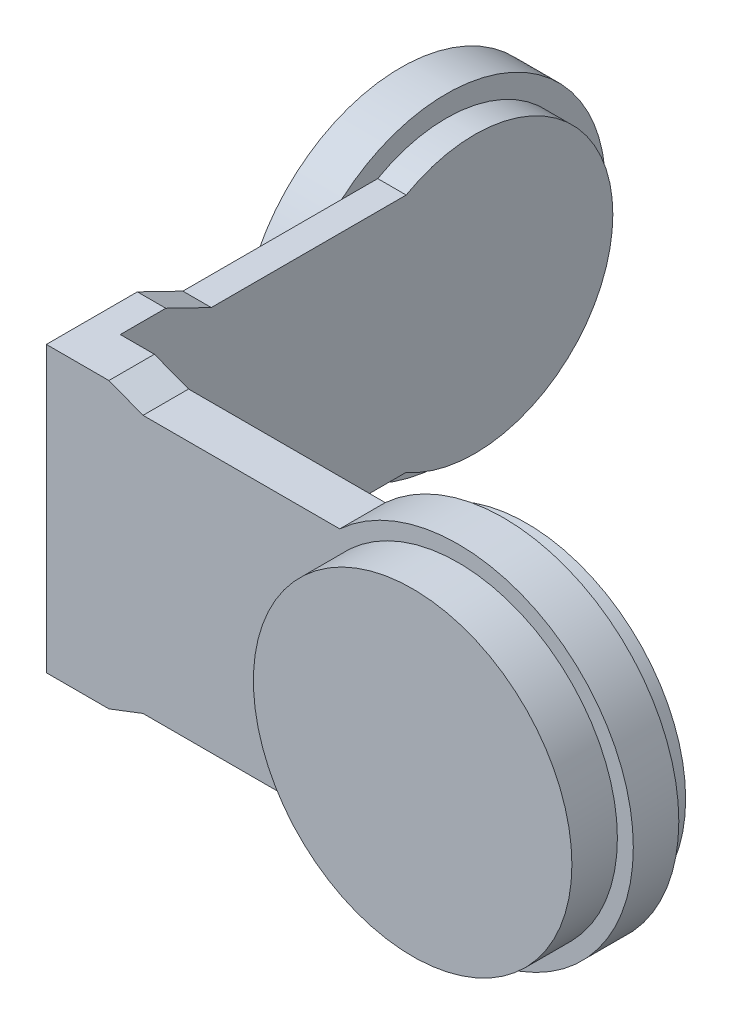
ISO-10303-21;
HEADER;
FILE_DESCRIPTION(('STEP AP214'),'2;1');
FILE_NAME('part.step','',(''),(''),'','','');
FILE_SCHEMA(('AUTOMOTIVE_DESIGN { 1 0 10303 214 1 1 1 1 }'));
ENDSEC;
DATA;
#1=APPLICATION_CONTEXT('core data for automotive mechanical design processes');
#2=APPLICATION_PROTOCOL_DEFINITION('international standard','automotive_design',2000,#1);
#3=PRODUCT_CONTEXT('',#1,'mechanical');
#4=PRODUCT('Part','Part','',(#3));
#5=PRODUCT_RELATED_PRODUCT_CATEGORY('part','',(#4));
#6=PRODUCT_DEFINITION_FORMATION('','',#4);
#7=PRODUCT_DEFINITION_CONTEXT('part definition',#1,'design');
#8=PRODUCT_DEFINITION('design','',#6,#7);
#9=PRODUCT_DEFINITION_SHAPE('','',#8);
#10=(LENGTH_UNIT() NAMED_UNIT(*) SI_UNIT(.MILLI.,.METRE.));
#11=(NAMED_UNIT(*) PLANE_ANGLE_UNIT() SI_UNIT($,.RADIAN.));
#12=(NAMED_UNIT(*) SI_UNIT($,.STERADIAN.) SOLID_ANGLE_UNIT());
#13=UNCERTAINTY_MEASURE_WITH_UNIT(LENGTH_MEASURE(1.E-05),#10,'distance_accuracy_value','');
#14=(GEOMETRIC_REPRESENTATION_CONTEXT(3) GLOBAL_UNCERTAINTY_ASSIGNED_CONTEXT((#13)) GLOBAL_UNIT_ASSIGNED_CONTEXT((#10,
#11,#12)) REPRESENTATION_CONTEXT('',''));
#15=CARTESIAN_POINT('',(0.,0.,0.));
#16=DIRECTION('',(0.,0.,1.));
#17=DIRECTION('',(1.,0.,0.));
#18=AXIS2_PLACEMENT_3D('',#15,#16,#17);
#19=CARTESIAN_POINT('',(6.5,0.,0.));
#20=DIRECTION('',(1.,0.,0.));
#21=DIRECTION('',(0.,0.,-1.));
#22=AXIS2_PLACEMENT_3D('',#19,#20,#21);
#23=PLANE('',#22);
#24=DIRECTION('',(0.,0.,1.));
#25=VECTOR('',#24,1.);
#26=CARTESIAN_POINT('',(6.5,12.5,35.15));
#27=LINE('',#26,#25);
#28=CARTESIAN_POINT('',(6.5,12.5,27.15));
#29=VERTEX_POINT('',#28);
#30=CARTESIAN_POINT('',(6.5,12.5,31.15));
#31=VERTEX_POINT('',#30);
#32=EDGE_CURVE('E216',#29,#31,#27,.T.);
#33=ORIENTED_EDGE('',*,*,#32,.T.);
#34=DIRECTION('',(0.,-1.,0.));
#35=VECTOR('',#34,1.);
#36=CARTESIAN_POINT('',(6.5,12.5,31.15));
#37=LINE('',#36,#35);
#38=CARTESIAN_POINT('',(6.5,-12.5,31.15));
#39=VERTEX_POINT('',#38);
#40=EDGE_CURVE('E162',#31,#39,#37,.T.);
#41=ORIENTED_EDGE('',*,*,#40,.T.);
#42=DIRECTION('',(0.,0.,-1.));
#43=VECTOR('',#42,1.);
#44=CARTESIAN_POINT('',(6.5,-12.5,35.15));
#45=LINE('',#44,#43);
#46=CARTESIAN_POINT('',(6.5,-12.5,27.15));
#47=VERTEX_POINT('',#46);
#48=EDGE_CURVE('E161',#39,#47,#45,.T.);
#49=ORIENTED_EDGE('',*,*,#48,.T.);
#50=DIRECTION('',(0.,0.437246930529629,-0.899341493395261));
#51=VECTOR('',#50,1.);
#52=CARTESIAN_POINT('',(6.5,-12.5,27.15));
#53=LINE('',#52,#51);
#54=CARTESIAN_POINT('',(6.5,-10.5552573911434,23.15));
#55=VERTEX_POINT('',#54);
#56=EDGE_CURVE('E204',#47,#55,#53,.T.);
#57=ORIENTED_EDGE('',*,*,#56,.T.);
#58=DIRECTION('',(0.,0.,-1.));
#59=VECTOR('',#58,1.);
#60=CARTESIAN_POINT('',(6.5,-10.5552573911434,23.15));
#61=LINE('',#60,#59);
#62=CARTESIAN_POINT('',(6.5,-10.5552573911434,6.0173949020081));
#63=VERTEX_POINT('',#62);
#64=EDGE_CURVE('E207',#55,#63,#61,.T.);
#65=ORIENTED_EDGE('',*,*,#64,.T.);
#66=CARTESIAN_POINT('',(6.5,0.,0.));
#67=DIRECTION('',(1.,0.,0.));
#68=DIRECTION('',(0.,0.,-1.));
#69=AXIS2_PLACEMENT_3D('',#66,#67,#68);
#70=CIRCLE('',#69,12.15);
#71=CARTESIAN_POINT('',(6.5,10.5552573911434,6.0173949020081));
#72=VERTEX_POINT('',#71);
#73=EDGE_CURVE('E210',#63,#72,#70,.T.);
#74=ORIENTED_EDGE('',*,*,#73,.T.);
#75=DIRECTION('',(0.,0.,1.));
#76=VECTOR('',#75,1.);
#77=CARTESIAN_POINT('',(6.5,10.5552573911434,23.15));
#78=LINE('',#77,#76);
#79=CARTESIAN_POINT('',(6.5,10.5552573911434,23.15));
#80=VERTEX_POINT('',#79);
#81=EDGE_CURVE('E212',#72,#80,#78,.T.);
#82=ORIENTED_EDGE('',*,*,#81,.T.);
#83=DIRECTION('',(0.,0.437246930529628,0.899341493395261));
#84=VECTOR('',#83,1.);
#85=CARTESIAN_POINT('',(6.5,12.5,27.15));
#86=LINE('',#85,#84);
#87=EDGE_CURVE('E214',#80,#29,#86,.T.);
#88=ORIENTED_EDGE('',*,*,#87,.T.);
#89=EDGE_LOOP('',(#33,#41,#49,#57,#65,#74,#82,#88));
#90=FACE_BOUND('',#89,.T.);
#91=ADVANCED_FACE('F33',(#90),#23,.T.);
#92=CARTESIAN_POINT('',(4.,0.,0.));
#93=DIRECTION('',(-1.,0.,0.));
#94=DIRECTION('',(0.,0.,1.));
#95=AXIS2_PLACEMENT_3D('',#92,#93,#94);
#96=CYLINDRICAL_SURFACE('',#95,14.);
#97=CARTESIAN_POINT('',(4.,0.,0.));
#98=DIRECTION('',(1.,0.,0.));
#99=DIRECTION('',(0.,0.,-1.));
#100=AXIS2_PLACEMENT_3D('',#97,#98,#99);
#101=CIRCLE('',#100,14.);
#102=CARTESIAN_POINT('',(4.,10.5552573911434,9.19709418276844));
#103=VERTEX_POINT('',#102);
#104=CARTESIAN_POINT('',(4.,-10.5552573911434,9.19709418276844));
#105=VERTEX_POINT('',#104);
#106=EDGE_CURVE('E261',#103,#105,#101,.T.);
#107=ORIENTED_EDGE('',*,*,#106,.F.);
#108=EDGE_CURVE('E263',#105,#103,#101,.T.);
#109=ORIENTED_EDGE('',*,*,#108,.F.);
#110=EDGE_LOOP('',(#107,#109));
#111=FACE_BOUND('',#110,.T.);
#112=CARTESIAN_POINT('',(0.,0.,0.));
#113=DIRECTION('',(1.,0.,0.));
#114=DIRECTION('',(0.,0.,-1.));
#115=AXIS2_PLACEMENT_3D('',#112,#113,#114);
#116=CIRCLE('',#115,14.);
#117=CARTESIAN_POINT('',(0.,0.,-14.));
#118=VERTEX_POINT('',#117);
#119=EDGE_CURVE('E260',#118,#118,#116,.T.);
#120=ORIENTED_EDGE('',*,*,#119,.T.);
#121=EDGE_LOOP('',(#120));
#122=FACE_BOUND('',#121,.T.);
#123=ADVANCED_FACE('F35',(#111,#122),#96,.T.);
#124=CARTESIAN_POINT('',(4.,0.,0.));
#125=DIRECTION('',(1.,0.,0.));
#126=DIRECTION('',(0.,0.,-1.));
#127=AXIS2_PLACEMENT_3D('',#124,#125,#126);
#128=PLANE('',#127);
#129=DIRECTION('',(0.,0.,1.));
#130=VECTOR('',#129,1.);
#131=CARTESIAN_POINT('',(4.,10.5552573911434,23.15));
#132=LINE('',#131,#130);
#133=CARTESIAN_POINT('',(4.,10.5552573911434,6.0173949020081));
#134=VERTEX_POINT('',#133);
#135=EDGE_CURVE('E56',#134,#103,#132,.T.);
#136=ORIENTED_EDGE('',*,*,#135,.F.);
#137=CARTESIAN_POINT('',(4.,0.,0.));
#138=DIRECTION('',(1.,0.,0.));
#139=DIRECTION('',(0.,0.,-1.));
#140=AXIS2_PLACEMENT_3D('',#137,#138,#139);
#141=CIRCLE('',#140,12.15);
#142=CARTESIAN_POINT('',(4.,-10.5552573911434,6.0173949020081));
#143=VERTEX_POINT('',#142);
#144=EDGE_CURVE('E226',#143,#134,#141,.T.);
#145=ORIENTED_EDGE('',*,*,#144,.F.);
#146=DIRECTION('',(0.,0.,-1.));
#147=VECTOR('',#146,1.);
#148=CARTESIAN_POINT('',(4.,-10.5552573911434,23.15));
#149=LINE('',#148,#147);
#150=EDGE_CURVE('E227',#105,#143,#149,.T.);
#151=ORIENTED_EDGE('',*,*,#150,.F.);
#152=ORIENTED_EDGE('',*,*,#108,.T.);
#153=EDGE_LOOP('',(#136,#145,#151,#152));
#154=FACE_BOUND('',#153,.T.);
#155=ADVANCED_FACE('F269',(#154),#128,.T.);
#156=CARTESIAN_POINT('',(0.,0.,0.));
#157=DIRECTION('',(1.,0.,0.));
#158=DIRECTION('',(0.,0.,-1.));
#159=AXIS2_PLACEMENT_3D('',#156,#157,#158);
#160=PLANE('',#159);
#161=ORIENTED_EDGE('',*,*,#119,.F.);
#162=EDGE_LOOP('',(#161));
#163=FACE_BOUND('',#162,.T.);
#164=ADVANCED_FACE('F330',(#163),#160,.F.);
#165=CARTESIAN_POINT('',(4.,0.,0.));
#166=DIRECTION('',(1.,0.,0.));
#167=DIRECTION('',(0.,0.,-1.));
#168=AXIS2_PLACEMENT_3D('',#165,#166,#167);
#169=PLANE('',#168);
#170=CARTESIAN_POINT('',(4.,10.5552573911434,23.15));
#171=VERTEX_POINT('',#170);
#172=EDGE_CURVE('E229',#103,#171,#132,.T.);
#173=ORIENTED_EDGE('',*,*,#172,.F.);
#174=ORIENTED_EDGE('',*,*,#106,.T.);
#175=CARTESIAN_POINT('',(4.,-10.5552573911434,23.15));
#176=VERTEX_POINT('',#175);
#177=EDGE_CURVE('E223',#176,#105,#149,.T.);
#178=ORIENTED_EDGE('',*,*,#177,.F.);
#179=DIRECTION('',(0.,0.437246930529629,-0.899341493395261));
#180=VECTOR('',#179,1.);
#181=CARTESIAN_POINT('',(4.,-12.5,27.15));
#182=LINE('',#181,#180);
#183=CARTESIAN_POINT('',(4.,-12.5,27.15));
#184=VERTEX_POINT('',#183);
#185=EDGE_CURVE('E196',#184,#176,#182,.T.);
#186=ORIENTED_EDGE('',*,*,#185,.F.);
#187=DIRECTION('',(0.,0.,-1.));
#188=VECTOR('',#187,1.);
#189=CARTESIAN_POINT('',(4.,-12.5,35.15));
#190=LINE('',#189,#188);
#191=CARTESIAN_POINT('',(4.,-12.5,35.15));
#192=VERTEX_POINT('',#191);
#193=EDGE_CURVE('E208',#192,#184,#190,.T.);
#194=ORIENTED_EDGE('',*,*,#193,.F.);
#195=DIRECTION('',(0.,-1.,0.));
#196=VECTOR('',#195,1.);
#197=CARTESIAN_POINT('',(4.,12.5,35.15));
#198=LINE('',#197,#196);
#199=CARTESIAN_POINT('',(4.,12.5,35.15));
#200=VERTEX_POINT('',#199);
#201=EDGE_CURVE('E235',#200,#192,#198,.T.);
#202=ORIENTED_EDGE('',*,*,#201,.F.);
#203=DIRECTION('',(0.,0.,1.));
#204=VECTOR('',#203,1.);
#205=CARTESIAN_POINT('',(4.,12.5,35.15));
#206=LINE('',#205,#204);
#207=CARTESIAN_POINT('',(4.,12.5,27.15));
#208=VERTEX_POINT('',#207);
#209=EDGE_CURVE('E233',#208,#200,#206,.T.);
#210=ORIENTED_EDGE('',*,*,#209,.F.);
#211=DIRECTION('',(0.,0.437246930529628,0.899341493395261));
#212=VECTOR('',#211,1.);
#213=CARTESIAN_POINT('',(4.,12.5,27.15));
#214=LINE('',#213,#212);
#215=EDGE_CURVE('E231',#171,#208,#214,.T.);
#216=ORIENTED_EDGE('',*,*,#215,.F.);
#217=EDGE_LOOP('',(#173,#174,#178,#186,#194,#202,#210,#216));
#218=FACE_BOUND('',#217,.T.);
#219=ADVANCED_FACE('F275',(#218),#169,.F.);
#220=CARTESIAN_POINT('',(6.5,-12.5,27.15));
#221=DIRECTION('',(0.,0.899341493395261,0.437246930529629));
#222=DIRECTION('',(0.,-0.437246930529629,0.899341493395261));
#223=AXIS2_PLACEMENT_3D('',#220,#221,#222);
#224=PLANE('',#223);
#225=ORIENTED_EDGE('',*,*,#185,.T.);
#226=DIRECTION('',(-1.,0.,0.));
#227=VECTOR('',#226,1.);
#228=CARTESIAN_POINT('',(6.5,-10.5552573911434,23.15));
#229=LINE('',#228,#227);
#230=EDGE_CURVE('E257',#55,#176,#229,.T.);
#231=ORIENTED_EDGE('',*,*,#230,.F.);
#232=ORIENTED_EDGE('',*,*,#56,.F.);
#233=DIRECTION('',(-1.,0.,0.));
#234=VECTOR('',#233,1.);
#235=CARTESIAN_POINT('',(6.5,-12.5,27.15));
#236=LINE('',#235,#234);
#237=EDGE_CURVE('E220',#47,#184,#236,.T.);
#238=ORIENTED_EDGE('',*,*,#237,.T.);
#239=EDGE_LOOP('',(#225,#231,#232,#238));
#240=FACE_BOUND('',#239,.T.);
#241=ADVANCED_FACE('F329',(#240),#224,.F.);
#242=CARTESIAN_POINT('',(6.5,-10.5552573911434,23.15));
#243=DIRECTION('',(0.,1.,0.));
#244=DIRECTION('',(0.,0.,1.));
#245=AXIS2_PLACEMENT_3D('',#242,#243,#244);
#246=PLANE('',#245);
#247=ORIENTED_EDGE('',*,*,#177,.T.);
#248=ORIENTED_EDGE('',*,*,#150,.T.);
#249=DIRECTION('',(-1.,0.,0.));
#250=VECTOR('',#249,1.);
#251=CARTESIAN_POINT('',(6.5,-10.5552573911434,6.0173949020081));
#252=LINE('',#251,#250);
#253=EDGE_CURVE('E254',#63,#143,#252,.T.);
#254=ORIENTED_EDGE('',*,*,#253,.F.);
#255=ORIENTED_EDGE('',*,*,#64,.F.);
#256=ORIENTED_EDGE('',*,*,#230,.T.);
#257=EDGE_LOOP('',(#247,#248,#254,#255,#256));
#258=FACE_BOUND('',#257,.T.);
#259=ADVANCED_FACE('F287',(#258),#246,.F.);
#260=CARTESIAN_POINT('',(6.5,0.,0.));
#261=DIRECTION('',(-1.,0.,0.));
#262=DIRECTION('',(0.,0.,1.));
#263=AXIS2_PLACEMENT_3D('',#260,#261,#262);
#264=CYLINDRICAL_SURFACE('',#263,12.15);
#265=ORIENTED_EDGE('',*,*,#144,.T.);
#266=DIRECTION('',(-1.,0.,0.));
#267=VECTOR('',#266,1.);
#268=CARTESIAN_POINT('',(6.5,10.5552573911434,6.0173949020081));
#269=LINE('',#268,#267);
#270=EDGE_CURVE('E251',#72,#134,#269,.T.);
#271=ORIENTED_EDGE('',*,*,#270,.F.);
#272=ORIENTED_EDGE('',*,*,#73,.F.);
#273=ORIENTED_EDGE('',*,*,#253,.T.);
#274=EDGE_LOOP('',(#265,#271,#272,#273));
#275=FACE_BOUND('',#274,.T.);
#276=ADVANCED_FACE('F284',(#275),#264,.T.);
#277=CARTESIAN_POINT('',(6.5,10.5552573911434,23.15));
#278=DIRECTION('',(0.,-1.,0.));
#279=DIRECTION('',(0.,0.,-1.));
#280=AXIS2_PLACEMENT_3D('',#277,#278,#279);
#281=PLANE('',#280);
#282=ORIENTED_EDGE('',*,*,#135,.T.);
#283=ORIENTED_EDGE('',*,*,#172,.T.);
#284=DIRECTION('',(-1.,0.,0.));
#285=VECTOR('',#284,1.);
#286=CARTESIAN_POINT('',(6.5,10.5552573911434,23.15));
#287=LINE('',#286,#285);
#288=EDGE_CURVE('E248',#80,#171,#287,.T.);
#289=ORIENTED_EDGE('',*,*,#288,.F.);
#290=ORIENTED_EDGE('',*,*,#81,.F.);
#291=ORIENTED_EDGE('',*,*,#270,.T.);
#292=EDGE_LOOP('',(#282,#283,#289,#290,#291));
#293=FACE_BOUND('',#292,.T.);
#294=ADVANCED_FACE('F279',(#293),#281,.F.);
#295=CARTESIAN_POINT('',(6.5,12.5,27.15));
#296=DIRECTION('',(0.,-0.899341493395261,0.437246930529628));
#297=DIRECTION('',(0.,-0.437246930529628,-0.899341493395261));
#298=AXIS2_PLACEMENT_3D('',#295,#296,#297);
#299=PLANE('',#298);
#300=ORIENTED_EDGE('',*,*,#215,.T.);
#301=DIRECTION('',(-1.,0.,0.));
#302=VECTOR('',#301,1.);
#303=CARTESIAN_POINT('',(6.5,12.5,27.15));
#304=LINE('',#303,#302);
#305=EDGE_CURVE('E245',#29,#208,#304,.T.);
#306=ORIENTED_EDGE('',*,*,#305,.F.);
#307=ORIENTED_EDGE('',*,*,#87,.F.);
#308=ORIENTED_EDGE('',*,*,#288,.T.);
#309=EDGE_LOOP('',(#300,#306,#307,#308));
#310=FACE_BOUND('',#309,.T.);
#311=ADVANCED_FACE('F341',(#310),#299,.F.);
#312=CARTESIAN_POINT('',(6.5,12.5,35.15));
#313=DIRECTION('',(0.,-1.,0.));
#314=DIRECTION('',(0.,0.,-1.));
#315=AXIS2_PLACEMENT_3D('',#312,#313,#314);
#316=PLANE('',#315);
#317=ORIENTED_EDGE('',*,*,#209,.T.);
#318=DIRECTION('',(-1.,0.,0.));
#319=VECTOR('',#318,1.);
#320=CARTESIAN_POINT('',(6.5,12.5,35.15));
#321=LINE('',#320,#319);
#322=CARTESIAN_POINT('',(9.5,12.5,35.15));
#323=VERTEX_POINT('',#322);
#324=EDGE_CURVE('E242',#323,#200,#321,.T.);
#325=ORIENTED_EDGE('',*,*,#324,.F.);
#326=DIRECTION('',(0.,0.,1.));
#327=VECTOR('',#326,1.);
#328=CARTESIAN_POINT('',(9.5,12.5,31.15));
#329=LINE('',#328,#327);
#330=CARTESIAN_POINT('',(9.5,12.5,31.15));
#331=VERTEX_POINT('',#330);
#332=EDGE_CURVE('E193',#331,#323,#329,.T.);
#333=ORIENTED_EDGE('',*,*,#332,.F.);
#334=DIRECTION('',(-1.,0.,0.));
#335=VECTOR('',#334,1.);
#336=CARTESIAN_POINT('',(6.5,12.5,31.15));
#337=LINE('',#336,#335);
#338=EDGE_CURVE('E150',#331,#31,#337,.T.);
#339=ORIENTED_EDGE('',*,*,#338,.T.);
#340=ORIENTED_EDGE('',*,*,#32,.F.);
#341=ORIENTED_EDGE('',*,*,#305,.T.);
#342=EDGE_LOOP('',(#317,#325,#333,#339,#340,#341));
#343=FACE_BOUND('',#342,.T.);
#344=ADVANCED_FACE('F337',(#343),#316,.F.);
#345=CARTESIAN_POINT('',(6.5,12.5,35.15));
#346=DIRECTION('',(0.,0.,-1.));
#347=DIRECTION('',(-1.,0.,0.));
#348=AXIS2_PLACEMENT_3D('',#345,#346,#347);
#349=PLANE('',#348);
#350=CARTESIAN_POINT('',(40.2,0.,35.15));
#351=DIRECTION('',(0.,0.,1.));
#352=DIRECTION('',(1.,0.,0.));
#353=AXIS2_PLACEMENT_3D('',#350,#351,#352);
#354=CIRCLE('',#353,14.);
#355=CARTESIAN_POINT('',(54.2,0.,35.15));
#356=VERTEX_POINT('',#355);
#357=EDGE_CURVE('E41',#356,#356,#354,.T.);
#358=ORIENTED_EDGE('',*,*,#357,.F.);
#359=EDGE_LOOP('',(#358));
#360=FACE_BOUND('',#359,.T.);
#361=ORIENTED_EDGE('',*,*,#201,.T.);
#362=DIRECTION('',(-1.,0.,0.));
#363=VECTOR('',#362,1.);
#364=CARTESIAN_POINT('',(6.5,-12.5,35.15));
#365=LINE('',#364,#363);
#366=CARTESIAN_POINT('',(9.5,-12.5,35.15));
#367=VERTEX_POINT('',#366);
#368=EDGE_CURVE('E240',#367,#192,#365,.T.);
#369=ORIENTED_EDGE('',*,*,#368,.F.);
#370=DIRECTION('',(0.933746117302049,0.357936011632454,0.));
#371=VECTOR('',#370,1.);
#372=CARTESIAN_POINT('',(9.5,-12.5,35.15));
#373=LINE('',#372,#371);
#374=CARTESIAN_POINT('',(12.5,-11.35,35.15));
#375=VERTEX_POINT('',#374);
#376=EDGE_CURVE('E146',#367,#375,#373,.T.);
#377=ORIENTED_EDGE('',*,*,#376,.T.);
#378=DIRECTION('',(1.,0.,0.));
#379=VECTOR('',#378,1.);
#380=CARTESIAN_POINT('',(12.5,-11.35,35.15));
#381=LINE('',#380,#379);
#382=CARTESIAN_POINT('',(29.7914698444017,-11.35,35.15));
#383=VERTEX_POINT('',#382);
#384=EDGE_CURVE('E181',#375,#383,#381,.T.);
#385=ORIENTED_EDGE('',*,*,#384,.T.);
#386=CARTESIAN_POINT('',(40.2,0.,35.15));
#387=DIRECTION('',(0.,0.,1.));
#388=DIRECTION('',(1.,0.,0.));
#389=AXIS2_PLACEMENT_3D('',#386,#387,#388);
#390=CIRCLE('',#389,15.4);
#391=CARTESIAN_POINT('',(29.7914698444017,11.35,35.15));
#392=VERTEX_POINT('',#391);
#393=EDGE_CURVE('E185',#383,#392,#390,.T.);
#394=ORIENTED_EDGE('',*,*,#393,.T.);
#395=DIRECTION('',(-1.,0.,0.));
#396=VECTOR('',#395,1.);
#397=CARTESIAN_POINT('',(12.5,11.35,35.15));
#398=LINE('',#397,#396);
#399=CARTESIAN_POINT('',(12.5,11.35,35.15));
#400=VERTEX_POINT('',#399);
#401=EDGE_CURVE('E188',#392,#400,#398,.T.);
#402=ORIENTED_EDGE('',*,*,#401,.T.);
#403=DIRECTION('',(-0.933746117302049,0.357936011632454,0.));
#404=VECTOR('',#403,1.);
#405=CARTESIAN_POINT('',(9.5,12.5,35.15));
#406=LINE('',#405,#404);
#407=EDGE_CURVE('E164',#400,#323,#406,.T.);
#408=ORIENTED_EDGE('',*,*,#407,.T.);
#409=ORIENTED_EDGE('',*,*,#324,.T.);
#410=EDGE_LOOP('',(#361,#369,#377,#385,#394,#402,#408,#409));
#411=FACE_BOUND('',#410,.T.);
#412=ADVANCED_FACE('F334',(#360,#411),#349,.F.);
#413=CARTESIAN_POINT('',(6.5,-12.5,35.15));
#414=DIRECTION('',(0.,1.,0.));
#415=DIRECTION('',(0.,0.,1.));
#416=AXIS2_PLACEMENT_3D('',#413,#414,#415);
#417=PLANE('',#416);
#418=ORIENTED_EDGE('',*,*,#193,.T.);
#419=ORIENTED_EDGE('',*,*,#237,.F.);
#420=ORIENTED_EDGE('',*,*,#48,.F.);
#421=DIRECTION('',(1.,0.,0.));
#422=VECTOR('',#421,1.);
#423=CARTESIAN_POINT('',(6.5,-12.5,31.15));
#424=LINE('',#423,#422);
#425=CARTESIAN_POINT('',(9.5,-12.5,31.15));
#426=VERTEX_POINT('',#425);
#427=EDGE_CURVE('E48',#39,#426,#424,.T.);
#428=ORIENTED_EDGE('',*,*,#427,.T.);
#429=DIRECTION('',(0.,0.,1.));
#430=VECTOR('',#429,1.);
#431=CARTESIAN_POINT('',(9.5,-12.5,31.15));
#432=LINE('',#431,#430);
#433=EDGE_CURVE('E142',#426,#367,#432,.T.);
#434=ORIENTED_EDGE('',*,*,#433,.T.);
#435=ORIENTED_EDGE('',*,*,#368,.T.);
#436=EDGE_LOOP('',(#418,#419,#420,#428,#434,#435));
#437=FACE_BOUND('',#436,.T.);
#438=ADVANCED_FACE('F159',(#437),#417,.F.);
#439=CARTESIAN_POINT('',(9.5,12.5,31.15));
#440=DIRECTION('',(0.357936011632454,0.933746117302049,0.));
#441=DIRECTION('',(-0.933746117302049,0.357936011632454,0.));
#442=AXIS2_PLACEMENT_3D('',#439,#440,#441);
#443=PLANE('',#442);
#444=ORIENTED_EDGE('',*,*,#407,.F.);
#445=DIRECTION('',(0.,0.,1.));
#446=VECTOR('',#445,1.);
#447=CARTESIAN_POINT('',(12.5,11.35,31.15));
#448=LINE('',#447,#446);
#449=CARTESIAN_POINT('',(12.5,11.35,31.15));
#450=VERTEX_POINT('',#449);
#451=EDGE_CURVE('E197',#450,#400,#448,.T.);
#452=ORIENTED_EDGE('',*,*,#451,.F.);
#453=DIRECTION('',(-0.933746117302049,0.357936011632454,0.));
#454=VECTOR('',#453,1.);
#455=CARTESIAN_POINT('',(9.5,12.5,31.15));
#456=LINE('',#455,#454);
#457=EDGE_CURVE('E175',#450,#331,#456,.T.);
#458=ORIENTED_EDGE('',*,*,#457,.T.);
#459=ORIENTED_EDGE('',*,*,#332,.T.);
#460=EDGE_LOOP('',(#444,#452,#458,#459));
#461=FACE_BOUND('',#460,.T.);
#462=ADVANCED_FACE('F333',(#461),#443,.T.);
#463=CARTESIAN_POINT('',(12.5,11.35,31.15));
#464=DIRECTION('',(0.,1.,0.));
#465=DIRECTION('',(-1.,0.,0.));
#466=AXIS2_PLACEMENT_3D('',#463,#464,#465);
#467=PLANE('',#466);
#468=ORIENTED_EDGE('',*,*,#401,.F.);
#469=DIRECTION('',(0.,0.,1.));
#470=VECTOR('',#469,1.);
#471=CARTESIAN_POINT('',(29.7914698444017,11.35,31.15));
#472=LINE('',#471,#470);
#473=CARTESIAN_POINT('',(29.7914698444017,11.35,31.15));
#474=VERTEX_POINT('',#473);
#475=EDGE_CURVE('E199',#474,#392,#472,.T.);
#476=ORIENTED_EDGE('',*,*,#475,.F.);
#477=DIRECTION('',(-1.,0.,0.));
#478=VECTOR('',#477,1.);
#479=CARTESIAN_POINT('',(12.5,11.35,31.15));
#480=LINE('',#479,#478);
#481=EDGE_CURVE('E172',#474,#450,#480,.T.);
#482=ORIENTED_EDGE('',*,*,#481,.T.);
#483=ORIENTED_EDGE('',*,*,#451,.T.);
#484=EDGE_LOOP('',(#468,#476,#482,#483));
#485=FACE_BOUND('',#484,.T.);
#486=ADVANCED_FACE('F407',(#485),#467,.T.);
#487=CARTESIAN_POINT('',(40.2,0.,31.15));
#488=DIRECTION('',(0.,0.,1.));
#489=DIRECTION('',(1.,0.,0.));
#490=AXIS2_PLACEMENT_3D('',#487,#488,#489);
#491=CYLINDRICAL_SURFACE('',#490,15.4);
#492=ORIENTED_EDGE('',*,*,#393,.F.);
#493=DIRECTION('',(0.,0.,1.));
#494=VECTOR('',#493,1.);
#495=CARTESIAN_POINT('',(29.7914698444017,-11.35,31.15));
#496=LINE('',#495,#494);
#497=CARTESIAN_POINT('',(29.7914698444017,-11.35,31.15));
#498=VERTEX_POINT('',#497);
#499=EDGE_CURVE('E201',#498,#383,#496,.T.);
#500=ORIENTED_EDGE('',*,*,#499,.F.);
#501=CARTESIAN_POINT('',(40.2,0.,31.15));
#502=DIRECTION('',(0.,0.,1.));
#503=DIRECTION('',(1.,0.,0.));
#504=AXIS2_PLACEMENT_3D('',#501,#502,#503);
#505=CIRCLE('',#504,15.4);
#506=EDGE_CURVE('E169',#498,#474,#505,.T.);
#507=ORIENTED_EDGE('',*,*,#506,.T.);
#508=ORIENTED_EDGE('',*,*,#475,.T.);
#509=EDGE_LOOP('',(#492,#500,#507,#508));
#510=FACE_BOUND('',#509,.T.);
#511=ADVANCED_FACE('F414',(#510),#491,.T.);
#512=CARTESIAN_POINT('',(12.5,-11.35,31.15));
#513=DIRECTION('',(0.,-1.,0.));
#514=DIRECTION('',(0.,0.,-1.));
#515=AXIS2_PLACEMENT_3D('',#512,#513,#514);
#516=PLANE('',#515);
#517=ORIENTED_EDGE('',*,*,#384,.F.);
#518=DIRECTION('',(0.,0.,1.));
#519=VECTOR('',#518,1.);
#520=CARTESIAN_POINT('',(12.5,-11.35,31.15));
#521=LINE('',#520,#519);
#522=CARTESIAN_POINT('',(12.5,-11.35,31.15));
#523=VERTEX_POINT('',#522);
#524=EDGE_CURVE('E149',#523,#375,#521,.T.);
#525=ORIENTED_EDGE('',*,*,#524,.F.);
#526=DIRECTION('',(1.,0.,0.));
#527=VECTOR('',#526,1.);
#528=CARTESIAN_POINT('',(12.5,-11.35,31.15));
#529=LINE('',#528,#527);
#530=EDGE_CURVE('E156',#523,#498,#529,.T.);
#531=ORIENTED_EDGE('',*,*,#530,.T.);
#532=ORIENTED_EDGE('',*,*,#499,.T.);
#533=EDGE_LOOP('',(#517,#525,#531,#532));
#534=FACE_BOUND('',#533,.T.);
#535=ADVANCED_FACE('F316',(#534),#516,.T.);
#536=CARTESIAN_POINT('',(9.5,-12.5,31.15));
#537=DIRECTION('',(0.357936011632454,-0.933746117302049,0.));
#538=DIRECTION('',(0.933746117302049,0.357936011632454,0.));
#539=AXIS2_PLACEMENT_3D('',#536,#537,#538);
#540=PLANE('',#539);
#541=ORIENTED_EDGE('',*,*,#376,.F.);
#542=ORIENTED_EDGE('',*,*,#433,.F.);
#543=DIRECTION('',(0.933746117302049,0.357936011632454,0.));
#544=VECTOR('',#543,1.);
#545=CARTESIAN_POINT('',(9.5,-12.5,31.15));
#546=LINE('',#545,#544);
#547=EDGE_CURVE('E144',#426,#523,#546,.T.);
#548=ORIENTED_EDGE('',*,*,#547,.T.);
#549=ORIENTED_EDGE('',*,*,#524,.T.);
#550=EDGE_LOOP('',(#541,#542,#548,#549));
#551=FACE_BOUND('',#550,.T.);
#552=ADVANCED_FACE('F143',(#551),#540,.T.);
#553=CARTESIAN_POINT('',(40.2,0.,31.15));
#554=DIRECTION('',(0.,0.,1.));
#555=DIRECTION('',(1.,0.,0.));
#556=AXIS2_PLACEMENT_3D('',#553,#554,#555);
#557=PLANE('',#556);
#558=CARTESIAN_POINT('',(40.2,0.,31.15));
#559=DIRECTION('',(0.,0.,1.));
#560=DIRECTION('',(1.,0.,0.));
#561=AXIS2_PLACEMENT_3D('',#558,#559,#560);
#562=CIRCLE('',#561,14.);
#563=CARTESIAN_POINT('',(54.2,0.,31.15));
#564=VERTEX_POINT('',#563);
#565=EDGE_CURVE('E11',#564,#564,#562,.F.);
#566=ORIENTED_EDGE('',*,*,#565,.F.);
#567=EDGE_LOOP('',(#566));
#568=FACE_BOUND('',#567,.T.);
#569=ORIENTED_EDGE('',*,*,#40,.F.);
#570=ORIENTED_EDGE('',*,*,#338,.F.);
#571=ORIENTED_EDGE('',*,*,#457,.F.);
#572=ORIENTED_EDGE('',*,*,#481,.F.);
#573=ORIENTED_EDGE('',*,*,#506,.F.);
#574=ORIENTED_EDGE('',*,*,#530,.F.);
#575=ORIENTED_EDGE('',*,*,#547,.F.);
#576=ORIENTED_EDGE('',*,*,#427,.F.);
#577=EDGE_LOOP('',(#569,#570,#571,#572,#573,#574,#575,#576));
#578=FACE_BOUND('',#577,.T.);
#579=ADVANCED_FACE('F153',(#568,#578),#557,.F.);
#580=CARTESIAN_POINT('',(40.2,0.,39.15));
#581=DIRECTION('',(0.,0.,-1.));
#582=DIRECTION('',(-1.,0.,0.));
#583=AXIS2_PLACEMENT_3D('',#580,#581,#582);
#584=CYLINDRICAL_SURFACE('',#583,14.);
#585=CARTESIAN_POINT('',(40.2,0.,39.15));
#586=DIRECTION('',(0.,0.,1.));
#587=DIRECTION('',(1.,0.,0.));
#588=AXIS2_PLACEMENT_3D('',#585,#586,#587);
#589=CIRCLE('',#588,14.);
#590=CARTESIAN_POINT('',(54.2,0.,39.15));
#591=VERTEX_POINT('',#590);
#592=EDGE_CURVE('E182',#591,#591,#589,.T.);
#593=ORIENTED_EDGE('',*,*,#592,.F.);
#594=EDGE_LOOP('',(#593));
#595=FACE_BOUND('',#594,.T.);
#596=ORIENTED_EDGE('',*,*,#357,.T.);
#597=EDGE_LOOP('',(#596));
#598=FACE_BOUND('',#597,.T.);
#599=ADVANCED_FACE('F308',(#595,#598),#584,.T.);
#600=CARTESIAN_POINT('',(40.2,0.,39.15));
#601=DIRECTION('',(0.,0.,1.));
#602=DIRECTION('',(1.,0.,0.));
#603=AXIS2_PLACEMENT_3D('',#600,#601,#602);
#604=PLANE('',#603);
#605=ORIENTED_EDGE('',*,*,#592,.T.);
#606=EDGE_LOOP('',(#605));
#607=FACE_BOUND('',#606,.T.);
#608=ADVANCED_FACE('F303',(#607),#604,.T.);
#609=CARTESIAN_POINT('',(40.2,0.,29.15));
#610=DIRECTION('',(0.,0.,1.));
#611=DIRECTION('',(1.,0.,0.));
#612=AXIS2_PLACEMENT_3D('',#609,#610,#611);
#613=CYLINDRICAL_SURFACE('',#612,14.);
#614=CARTESIAN_POINT('',(40.2,0.,29.15));
#615=DIRECTION('',(0.,0.,-1.));
#616=DIRECTION('',(-1.,0.,0.));
#617=AXIS2_PLACEMENT_3D('',#614,#615,#616);
#618=CIRCLE('',#617,14.);
#619=CARTESIAN_POINT('',(26.2,0.,29.15));
#620=VERTEX_POINT('',#619);
#621=EDGE_CURVE('E294',#620,#620,#618,.T.);
#622=ORIENTED_EDGE('',*,*,#621,.F.);
#623=EDGE_LOOP('',(#622));
#624=FACE_BOUND('',#623,.T.);
#625=ORIENTED_EDGE('',*,*,#565,.T.);
#626=EDGE_LOOP('',(#625));
#627=FACE_BOUND('',#626,.T.);
#628=ADVANCED_FACE('F300',(#624,#627),#613,.T.);
#629=CARTESIAN_POINT('',(40.2,0.,29.15));
#630=DIRECTION('',(0.,0.,-1.));
#631=DIRECTION('',(-1.,0.,0.));
#632=AXIS2_PLACEMENT_3D('',#629,#630,#631);
#633=PLANE('',#632);
#634=ORIENTED_EDGE('',*,*,#621,.T.);
#635=EDGE_LOOP('',(#634));
#636=FACE_BOUND('',#635,.T.);
#637=ADVANCED_FACE('F298',(#636),#633,.T.);
#638=CLOSED_SHELL('',(#91,#123,#155,#164,#219,#241,#259,#276,#294,#311,#344,#412,#438,#462,#486,
#511,#535,#552,#579,#599,#608,#628,#637));
#639=MANIFOLD_SOLID_BREP('B2',#638);
#640=ADVANCED_BREP_SHAPE_REPRESENTATION('',(#18,#639),#14);
#641=SHAPE_DEFINITION_REPRESENTATION(#9,#640);
ENDSEC;
END-ISO-10303-21;
